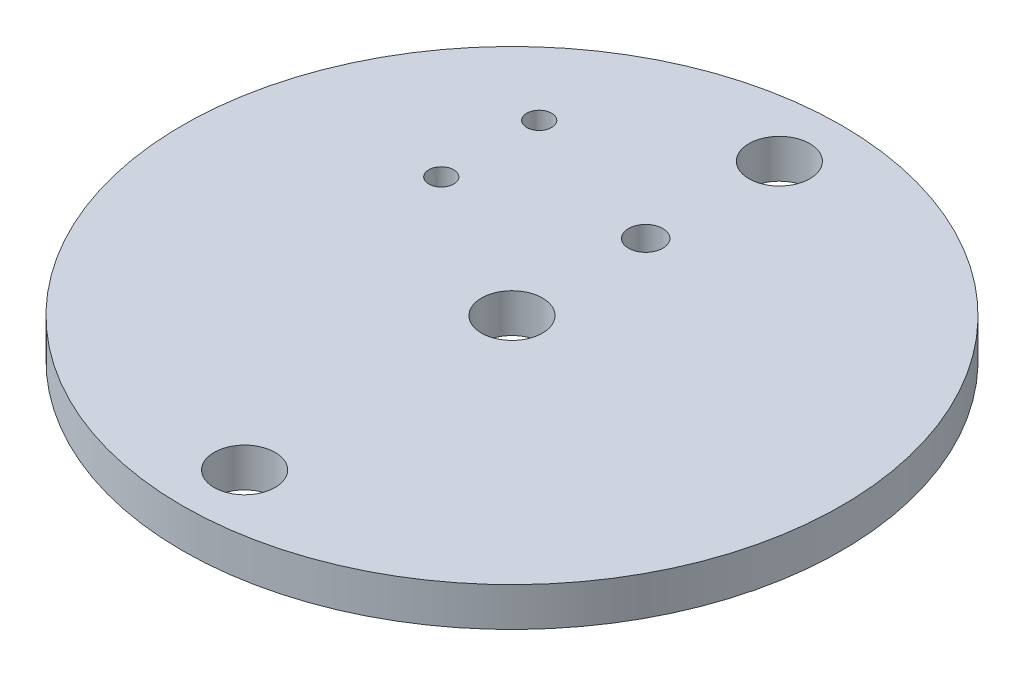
from build123d import *

# Parameters (mm, degrees)
SKETCH1_R              = 26.924
BOSS_EXTRUDE1_DEPTH    = 3.175
F_10_CLEARANCE_HOLE1_D = 4.9784
SKETCH5_R              = 1.4
SKETCH5_R_2            = 1.016
CUT_EXTRUDE1_DEPTH     = 39.208430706


with BuildPart() as part:
    # Sketch1 → Boss-Extrude1 (new body)
    with BuildSketch(Plane(origin=(0, 0, 0), x_dir=(1, 0, 0), z_dir=(0, 1, 0))):
        with Locations(Location((0, 0, 0), (0, 0, 270))):
            Circle(SKETCH1_R)
    extrude(amount=BOSS_EXTRUDE1_DEPTH)

    # 10 Clearance Hole1 (through all)
    with Locations(Plane(origin=(0, 3.175, 0), x_dir=(1, 0, 0), z_dir=(0, 1, 0))):
        with Locations((0, 0), (0, -21.844), (0, 21.844)):
            Hole(F_10_CLEARANCE_HOLE1_D / 2)

    # Sketch5 → Cut-Extrude1 (cut, through all)
    with BuildSketch(Plane(origin=(0, 3.175, 0), x_dir=(1, 0, 0), z_dir=(0, 1, 0))):
        with Locations(Location((0, 10.922, 0), (0, 0, 270))):
            Circle(SKETCH5_R)
        with Locations(Location((-12.7, 14.922, 0), (0, 0, 270))):
            Circle(SKETCH5_R_2)
        with Locations(Location((-12.7, 6.922, 0), (0, 0, 270))):
            Circle(SKETCH5_R_2)
    extrude(amount=-CUT_EXTRUDE1_DEPTH, mode=Mode.SUBTRACT)


solid = part.part
